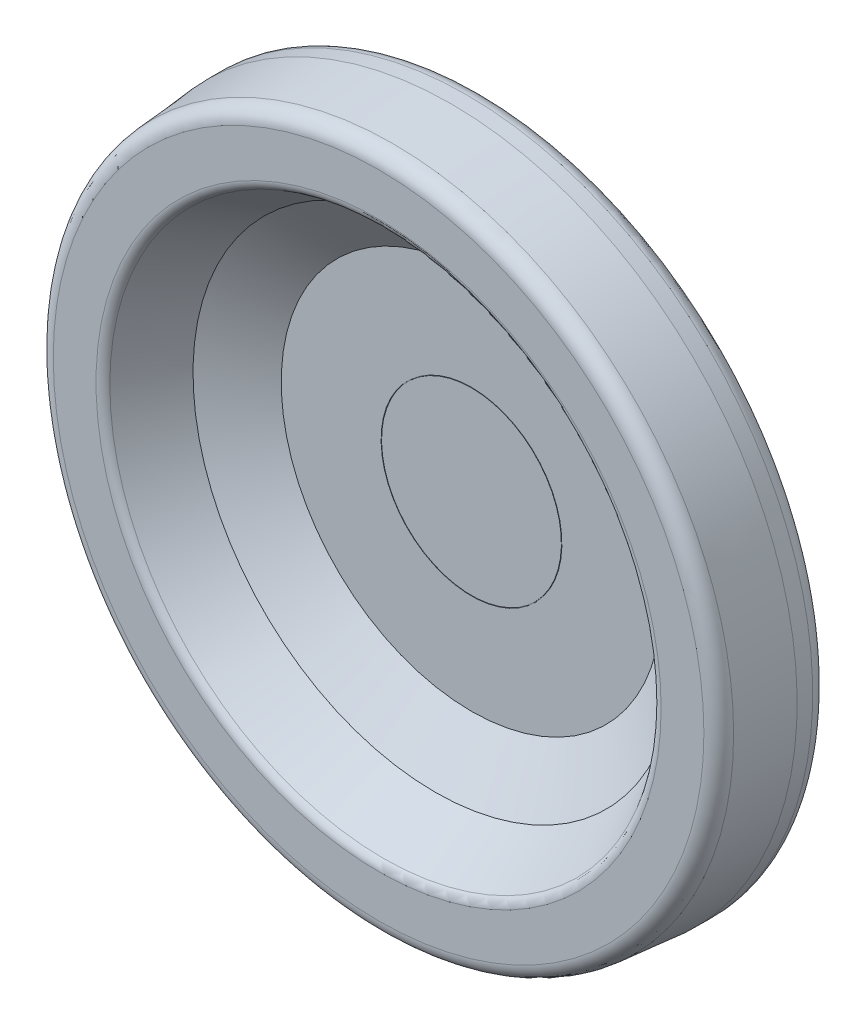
ISO-10303-21;
HEADER;
FILE_DESCRIPTION(('STEP AP214'),'2;1');
FILE_NAME('part.step','',(''),(''),'','','');
FILE_SCHEMA(('AUTOMOTIVE_DESIGN { 1 0 10303 214 1 1 1 1 }'));
ENDSEC;
DATA;
#1=APPLICATION_CONTEXT('core data for automotive mechanical design processes');
#2=APPLICATION_PROTOCOL_DEFINITION('international standard','automotive_design',2000,#1);
#3=PRODUCT_CONTEXT('',#1,'mechanical');
#4=PRODUCT('Part','Part','',(#3));
#5=PRODUCT_RELATED_PRODUCT_CATEGORY('part','',(#4));
#6=PRODUCT_DEFINITION_FORMATION('','',#4);
#7=PRODUCT_DEFINITION_CONTEXT('part definition',#1,'design');
#8=PRODUCT_DEFINITION('design','',#6,#7);
#9=PRODUCT_DEFINITION_SHAPE('','',#8);
#10=(LENGTH_UNIT() NAMED_UNIT(*) SI_UNIT(.MILLI.,.METRE.));
#11=(NAMED_UNIT(*) PLANE_ANGLE_UNIT() SI_UNIT($,.RADIAN.));
#12=(NAMED_UNIT(*) SI_UNIT($,.STERADIAN.) SOLID_ANGLE_UNIT());
#13=UNCERTAINTY_MEASURE_WITH_UNIT(LENGTH_MEASURE(1.E-05),#10,'distance_accuracy_value','');
#14=(GEOMETRIC_REPRESENTATION_CONTEXT(3) GLOBAL_UNCERTAINTY_ASSIGNED_CONTEXT((#13)) GLOBAL_UNIT_ASSIGNED_CONTEXT((#10,
#11,#12)) REPRESENTATION_CONTEXT('',''));
#15=CARTESIAN_POINT('',(0.,0.,0.));
#16=DIRECTION('',(0.,0.,1.));
#17=DIRECTION('',(1.,0.,0.));
#18=AXIS2_PLACEMENT_3D('',#15,#16,#17);
#19=CARTESIAN_POINT('',(13.25,0.,40.));
#20=DIRECTION('',(0.,0.,-1.));
#21=DIRECTION('',(0.,1.,0.));
#22=AXIS2_PLACEMENT_3D('',#19,#20,#21);
#23=PLANE('',#22);
#24=CARTESIAN_POINT('',(0.,0.,40.));
#25=DIRECTION('',(0.,0.,-1.));
#26=DIRECTION('',(0.,1.,0.));
#27=AXIS2_PLACEMENT_3D('',#24,#25,#26);
#28=CIRCLE('',#27,26.5);
#29=CARTESIAN_POINT('',(0.,26.5,40.));
#30=VERTEX_POINT('',#29);
#31=EDGE_CURVE('E391',#30,#30,#28,.T.);
#32=ORIENTED_EDGE('',*,*,#31,.T.);
#33=EDGE_LOOP('',(#32));
#34=FACE_BOUND('',#33,.T.);
#35=ADVANCED_FACE('F14',(#34),#23,.T.);
#36=CARTESIAN_POINT('',(13.,0.,41.15));
#37=DIRECTION('',(0.,0.,1.));
#38=DIRECTION('',(0.,-1.,0.));
#39=AXIS2_PLACEMENT_3D('',#36,#37,#38);
#40=PLANE('',#39);
#41=CARTESIAN_POINT('',(0.,0.,41.15));
#42=DIRECTION('',(0.,0.,-1.));
#43=DIRECTION('',(0.,1.,0.));
#44=AXIS2_PLACEMENT_3D('',#41,#42,#43);
#45=CIRCLE('',#44,26.);
#46=CARTESIAN_POINT('',(0.,26.,41.15));
#47=VERTEX_POINT('',#46);
#48=EDGE_CURVE('E388',#47,#47,#45,.T.);
#49=ORIENTED_EDGE('',*,*,#48,.F.);
#50=EDGE_LOOP('',(#49));
#51=FACE_BOUND('',#50,.T.);
#52=ADVANCED_FACE('F173',(#51),#40,.T.);
#53=CARTESIAN_POINT('',(0.,0.,36.85));
#54=DIRECTION('',(0.,0.,-1.));
#55=DIRECTION('',(0.,1.,0.));
#56=AXIS2_PLACEMENT_3D('',#53,#54,#55);
#57=CYLINDRICAL_SURFACE('',#56,26.5);
#58=CARTESIAN_POINT('',(0.,0.,33.7));
#59=DIRECTION('',(0.,0.,-1.));
#60=DIRECTION('',(0.,1.,0.));
#61=AXIS2_PLACEMENT_3D('',#58,#59,#60);
#62=CIRCLE('',#61,26.5);
#63=CARTESIAN_POINT('',(0.,26.5,33.7));
#64=VERTEX_POINT('',#63);
#65=EDGE_CURVE('E385',#64,#64,#62,.F.);
#66=ORIENTED_EDGE('',*,*,#65,.F.);
#67=EDGE_LOOP('',(#66));
#68=FACE_BOUND('',#67,.T.);
#69=ORIENTED_EDGE('',*,*,#31,.F.);
#70=EDGE_LOOP('',(#69));
#71=FACE_BOUND('',#70,.T.);
#72=ADVANCED_FACE('F169',(#68,#71),#57,.F.);
#73=CARTESIAN_POINT('',(0.,0.,41.023));
#74=DIRECTION('',(0.,0.,-1.));
#75=DIRECTION('',(0.,1.,0.));
#76=AXIS2_PLACEMENT_3D('',#73,#74,#75);
#77=CYLINDRICAL_SURFACE('',#76,26.);
#78=ORIENTED_EDGE('',*,*,#48,.T.);
#79=EDGE_LOOP('',(#78));
#80=FACE_BOUND('',#79,.T.);
#81=CARTESIAN_POINT('',(0.,0.,40.896));
#82=DIRECTION('',(0.,0.,-1.));
#83=DIRECTION('',(0.,1.,0.));
#84=AXIS2_PLACEMENT_3D('',#81,#82,#83);
#85=CIRCLE('',#84,26.);
#86=CARTESIAN_POINT('',(0.,26.,40.896));
#87=VERTEX_POINT('',#86);
#88=EDGE_CURVE('E382',#87,#87,#85,.T.);
#89=ORIENTED_EDGE('',*,*,#88,.F.);
#90=EDGE_LOOP('',(#89));
#91=FACE_BOUND('',#90,.T.);
#92=ADVANCED_FACE('F165',(#80,#91),#77,.T.);
#93=CARTESIAN_POINT('',(25.75,0.,33.7));
#94=DIRECTION('',(0.,0.,1.));
#95=DIRECTION('',(0.,-1.,0.));
#96=AXIS2_PLACEMENT_3D('',#93,#94,#95);
#97=PLANE('',#96);
#98=ORIENTED_EDGE('',*,*,#65,.T.);
#99=EDGE_LOOP('',(#98));
#100=FACE_BOUND('',#99,.T.);
#101=CARTESIAN_POINT('',(0.,0.,33.7));
#102=DIRECTION('',(0.,0.,-1.));
#103=DIRECTION('',(0.,1.,0.));
#104=AXIS2_PLACEMENT_3D('',#101,#102,#103);
#105=CIRCLE('',#104,25.);
#106=CARTESIAN_POINT('',(0.,25.,33.7));
#107=VERTEX_POINT('',#106);
#108=EDGE_CURVE('E379',#107,#107,#105,.T.);
#109=ORIENTED_EDGE('',*,*,#108,.T.);
#110=EDGE_LOOP('',(#109));
#111=FACE_BOUND('',#110,.T.);
#112=ADVANCED_FACE('F161',(#100,#111),#97,.T.);
#113=CARTESIAN_POINT('',(26.0635,0.,40.896));
#114=DIRECTION('',(0.,0.,1.));
#115=DIRECTION('',(0.,-1.,0.));
#116=AXIS2_PLACEMENT_3D('',#113,#114,#115);
#117=PLANE('',#116);
#118=CARTESIAN_POINT('',(0.,0.,40.896));
#119=DIRECTION('',(0.,0.,-1.));
#120=DIRECTION('',(0.,1.,0.));
#121=AXIS2_PLACEMENT_3D('',#118,#119,#120);
#122=CIRCLE('',#121,26.127);
#123=CARTESIAN_POINT('',(0.,26.127,40.896));
#124=VERTEX_POINT('',#123);
#125=EDGE_CURVE('E376',#124,#124,#122,.F.);
#126=ORIENTED_EDGE('',*,*,#125,.T.);
#127=EDGE_LOOP('',(#126));
#128=FACE_BOUND('',#127,.T.);
#129=ORIENTED_EDGE('',*,*,#88,.T.);
#130=EDGE_LOOP('',(#129));
#131=FACE_BOUND('',#130,.T.);
#132=ADVANCED_FACE('F157',(#128,#131),#117,.T.);
#133=CARTESIAN_POINT('',(0.,0.,32.35));
#134=DIRECTION('',(0.,0.,-1.));
#135=DIRECTION('',(0.,1.,0.));
#136=AXIS2_PLACEMENT_3D('',#133,#134,#135);
#137=CYLINDRICAL_SURFACE('',#136,25.);
#138=CARTESIAN_POINT('',(0.,0.,31.));
#139=DIRECTION('',(0.,0.,-1.));
#140=DIRECTION('',(0.,1.,0.));
#141=AXIS2_PLACEMENT_3D('',#138,#139,#140);
#142=CIRCLE('',#141,25.);
#143=CARTESIAN_POINT('',(0.,25.,31.));
#144=VERTEX_POINT('',#143);
#145=EDGE_CURVE('E373',#144,#144,#142,.F.);
#146=ORIENTED_EDGE('',*,*,#145,.F.);
#147=EDGE_LOOP('',(#146));
#148=FACE_BOUND('',#147,.T.);
#149=ORIENTED_EDGE('',*,*,#108,.F.);
#150=EDGE_LOOP('',(#149));
#151=FACE_BOUND('',#150,.T.);
#152=ADVANCED_FACE('F153',(#148,#151),#137,.F.);
#153=CARTESIAN_POINT('',(0.,0.,41.023));
#154=DIRECTION('',(0.,0.,-1.));
#155=DIRECTION('',(0.,1.,0.));
#156=AXIS2_PLACEMENT_3D('',#153,#154,#155);
#157=CYLINDRICAL_SURFACE('',#156,26.127);
#158=ORIENTED_EDGE('',*,*,#125,.F.);
#159=EDGE_LOOP('',(#158));
#160=FACE_BOUND('',#159,.T.);
#161=CARTESIAN_POINT('',(0.,0.,41.15));
#162=DIRECTION('',(0.,0.,-1.));
#163=DIRECTION('',(0.,1.,0.));
#164=AXIS2_PLACEMENT_3D('',#161,#162,#163);
#165=CIRCLE('',#164,26.127);
#166=CARTESIAN_POINT('',(0.,26.127,41.15));
#167=VERTEX_POINT('',#166);
#168=EDGE_CURVE('E370',#167,#167,#165,.T.);
#169=ORIENTED_EDGE('',*,*,#168,.F.);
#170=EDGE_LOOP('',(#169));
#171=FACE_BOUND('',#170,.T.);
#172=ADVANCED_FACE('F149',(#160,#171),#157,.F.);
#173=CARTESIAN_POINT('',(17.5,0.,31.));
#174=DIRECTION('',(0.,0.,1.));
#175=DIRECTION('',(0.,-1.,0.));
#176=AXIS2_PLACEMENT_3D('',#173,#174,#175);
#177=PLANE('',#176);
#178=ORIENTED_EDGE('',*,*,#145,.T.);
#179=EDGE_LOOP('',(#178));
#180=FACE_BOUND('',#179,.T.);
#181=CARTESIAN_POINT('',(0.,0.,31.));
#182=DIRECTION('',(0.,0.,-1.));
#183=DIRECTION('',(0.,1.,0.));
#184=AXIS2_PLACEMENT_3D('',#181,#182,#183);
#185=CIRCLE('',#184,10.);
#186=CARTESIAN_POINT('',(0.,10.,31.));
#187=VERTEX_POINT('',#186);
#188=EDGE_CURVE('E367',#187,#187,#185,.T.);
#189=ORIENTED_EDGE('',*,*,#188,.T.);
#190=EDGE_LOOP('',(#189));
#191=FACE_BOUND('',#190,.T.);
#192=ADVANCED_FACE('F145',(#180,#191),#177,.T.);
#193=CARTESIAN_POINT('',(40.5635,0.,41.15));
#194=DIRECTION('',(0.,0.,1.));
#195=DIRECTION('',(0.,-1.,0.));
#196=AXIS2_PLACEMENT_3D('',#193,#194,#195);
#197=PLANE('',#196);
#198=CARTESIAN_POINT('',(0.,0.,41.15));
#199=DIRECTION('',(0.,0.,1.));
#200=DIRECTION('',(0.,-1.,0.));
#201=AXIS2_PLACEMENT_3D('',#198,#199,#200);
#202=CIRCLE('',#201,55.);
#203=CARTESIAN_POINT('',(0.,-55.,41.15));
#204=VERTEX_POINT('',#203);
#205=EDGE_CURVE('E364',#204,#204,#202,.T.);
#206=ORIENTED_EDGE('',*,*,#205,.T.);
#207=EDGE_LOOP('',(#206));
#208=FACE_BOUND('',#207,.T.);
#209=ORIENTED_EDGE('',*,*,#168,.T.);
#210=EDGE_LOOP('',(#209));
#211=FACE_BOUND('',#210,.T.);
#212=ADVANCED_FACE('F141',(#208,#211),#197,.T.);
#213=CARTESIAN_POINT('',(0.,0.,15.5));
#214=DIRECTION('',(0.,0.,-1.));
#215=DIRECTION('',(0.,1.,0.));
#216=AXIS2_PLACEMENT_3D('',#213,#214,#215);
#217=CYLINDRICAL_SURFACE('',#216,10.);
#218=CARTESIAN_POINT('',(0.,0.,0.));
#219=DIRECTION('',(0.,0.,-1.));
#220=DIRECTION('',(0.,1.,0.));
#221=AXIS2_PLACEMENT_3D('',#218,#219,#220);
#222=CIRCLE('',#221,10.);
#223=CARTESIAN_POINT('',(0.,10.,0.));
#224=VERTEX_POINT('',#223);
#225=EDGE_CURVE('E361',#224,#224,#222,.F.);
#226=ORIENTED_EDGE('',*,*,#225,.F.);
#227=EDGE_LOOP('',(#226));
#228=FACE_BOUND('',#227,.T.);
#229=ORIENTED_EDGE('',*,*,#188,.F.);
#230=EDGE_LOOP('',(#229));
#231=FACE_BOUND('',#230,.T.);
#232=ADVANCED_FACE('F137',(#228,#231),#217,.F.);
#233=CARTESIAN_POINT('',(0.,0.,51.6531130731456));
#234=DIRECTION('',(0.,0.,1.));
#235=DIRECTION('',(0.,-1.,0.));
#236=AXIS2_PLACEMENT_3D('',#233,#234,#235);
#237=CONICAL_SURFACE('',#236,70.,0.959931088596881);
#238=ORIENTED_EDGE('',*,*,#205,.F.);
#239=EDGE_LOOP('',(#238));
#240=FACE_BOUND('',#239,.T.);
#241=CARTESIAN_POINT('',(0.,0.,51.6531130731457));
#242=DIRECTION('',(0.,0.,1.));
#243=DIRECTION('',(1.,0.,0.));
#244=AXIS2_PLACEMENT_3D('',#241,#242,#243);
#245=CIRCLE('',#244,70.);
#246=CARTESIAN_POINT('',(70.,0.,51.6531130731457));
#247=VERTEX_POINT('',#246);
#248=EDGE_CURVE('E355',#247,#247,#245,.T.);
#249=ORIENTED_EDGE('',*,*,#248,.T.);
#250=EDGE_LOOP('',(#249));
#251=FACE_BOUND('',#250,.T.);
#252=ADVANCED_FACE('F133',(#240,#251),#237,.F.);
#253=CARTESIAN_POINT('',(15.,0.,0.));
#254=DIRECTION('',(0.,0.,-1.));
#255=DIRECTION('',(0.,1.,0.));
#256=AXIS2_PLACEMENT_3D('',#253,#254,#255);
#257=PLANE('',#256);
#258=ORIENTED_EDGE('',*,*,#225,.T.);
#259=EDGE_LOOP('',(#258));
#260=FACE_BOUND('',#259,.T.);
#261=CARTESIAN_POINT('',(0.,0.,0.));
#262=DIRECTION('',(0.,0.,-1.));
#263=DIRECTION('',(0.,1.,0.));
#264=AXIS2_PLACEMENT_3D('',#261,#262,#263);
#265=CIRCLE('',#264,20.);
#266=CARTESIAN_POINT('',(0.,20.,0.));
#267=VERTEX_POINT('',#266);
#268=EDGE_CURVE('E358',#267,#267,#265,.F.);
#269=ORIENTED_EDGE('',*,*,#268,.F.);
#270=EDGE_LOOP('',(#269));
#271=FACE_BOUND('',#270,.T.);
#272=ADVANCED_FACE('F129',(#260,#271),#257,.T.);
#273=CARTESIAN_POINT('',(0.,0.,68.));
#274=DIRECTION('',(0.,0.,1.));
#275=DIRECTION('',(0.,-1.,0.));
#276=AXIS2_PLACEMENT_3D('',#273,#274,#275);
#277=CONICAL_SURFACE('',#276,80.,0.549005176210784);
#278=CARTESIAN_POINT('',(0.,0.,66.5655165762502));
#279=DIRECTION('',(0.,0.,1.));
#280=DIRECTION('',(0.,-1.,0.));
#281=AXIS2_PLACEMENT_3D('',#278,#279,#280);
#282=CIRCLE('',#281,79.1224730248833);
#283=CARTESIAN_POINT('',(0.,-79.1224730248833,66.5655165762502));
#284=VERTEX_POINT('',#283);
#285=EDGE_CURVE('E9',#284,#284,#282,.T.);
#286=ORIENTED_EDGE('',*,*,#285,.T.);
#287=EDGE_LOOP('',(#286));
#288=FACE_BOUND('',#287,.T.);
#289=ORIENTED_EDGE('',*,*,#248,.F.);
#290=EDGE_LOOP('',(#289));
#291=FACE_BOUND('',#290,.T.);
#292=ADVANCED_FACE('F125',(#288,#291),#277,.F.);
#293=CARTESIAN_POINT('',(0.,0.,0.127000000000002));
#294=DIRECTION('',(0.,0.,-1.));
#295=DIRECTION('',(0.,1.,0.));
#296=AXIS2_PLACEMENT_3D('',#293,#294,#295);
#297=CYLINDRICAL_SURFACE('',#296,20.);
#298=CARTESIAN_POINT('',(0.,0.,0.254));
#299=DIRECTION('',(0.,0.,-1.));
#300=DIRECTION('',(0.,1.,0.));
#301=AXIS2_PLACEMENT_3D('',#298,#299,#300);
#302=CIRCLE('',#301,20.);
#303=CARTESIAN_POINT('',(0.,20.,0.254));
#304=VERTEX_POINT('',#303);
#305=EDGE_CURVE('E63',#304,#304,#302,.F.);
#306=ORIENTED_EDGE('',*,*,#305,.F.);
#307=EDGE_LOOP('',(#306));
#308=FACE_BOUND('',#307,.T.);
#309=ORIENTED_EDGE('',*,*,#268,.T.);
#310=EDGE_LOOP('',(#309));
#311=FACE_BOUND('',#310,.T.);
#312=ADVANCED_FACE('F112',(#308,#311),#297,.T.);
#313=CARTESIAN_POINT('',(87.0196238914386,0.,68.));
#314=DIRECTION('',(0.,0.,1.));
#315=DIRECTION('',(0.,-1.,0.));
#316=AXIS2_PLACEMENT_3D('',#313,#314,#315);
#317=PLANE('',#316);
#318=CARTESIAN_POINT('',(0.,0.,68.));
#319=DIRECTION('',(0.,0.,1.));
#320=DIRECTION('',(1.,0.,0.));
#321=AXIS2_PLACEMENT_3D('',#318,#319,#320);
#322=CIRCLE('',#321,81.681605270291);
#323=CARTESIAN_POINT('',(81.681605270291,0.,68.));
#324=VERTEX_POINT('',#323);
#325=EDGE_CURVE('E23',#324,#324,#322,.F.);
#326=ORIENTED_EDGE('',*,*,#325,.T.);
#327=EDGE_LOOP('',(#326));
#328=FACE_BOUND('',#327,.T.);
#329=CARTESIAN_POINT('',(0.,0.,68.));
#330=DIRECTION('',(0.,0.,-1.));
#331=DIRECTION('',(0.,-1.,0.));
#332=AXIS2_PLACEMENT_3D('',#329,#330,#331);
#333=CIRCLE('',#332,94.0392477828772);
#334=CARTESIAN_POINT('',(0.,-94.0392477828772,68.));
#335=VERTEX_POINT('',#334);
#336=CARTESIAN_POINT('',(0.,94.0392477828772,68.));
#337=VERTEX_POINT('',#336);
#338=EDGE_CURVE('E53',#335,#337,#333,.T.);
#339=ORIENTED_EDGE('',*,*,#338,.F.);
#340=CARTESIAN_POINT('',(0.,0.,68.));
#341=DIRECTION('',(0.,0.,-1.));
#342=DIRECTION('',(1.,0.,0.));
#343=AXIS2_PLACEMENT_3D('',#340,#341,#342);
#344=CIRCLE('',#343,94.0392477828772);
#345=CARTESIAN_POINT('',(94.0392477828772,0.,68.));
#346=VERTEX_POINT('',#345);
#347=EDGE_CURVE('E59',#346,#335,#344,.T.);
#348=ORIENTED_EDGE('',*,*,#347,.F.);
#349=CARTESIAN_POINT('',(0.,0.,68.));
#350=DIRECTION('',(0.,0.,-1.));
#351=DIRECTION('',(0.,1.,0.));
#352=AXIS2_PLACEMENT_3D('',#349,#350,#351);
#353=CIRCLE('',#352,94.0392477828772);
#354=EDGE_CURVE('E61',#337,#346,#353,.T.);
#355=ORIENTED_EDGE('',*,*,#354,.F.);
#356=EDGE_LOOP('',(#339,#348,#355));
#357=FACE_BOUND('',#356,.T.);
#358=ADVANCED_FACE('F58',(#328,#357),#317,.T.);
#359=CARTESIAN_POINT('',(22.75,0.,0.254));
#360=DIRECTION('',(0.,0.,-1.));
#361=DIRECTION('',(1.,0.,0.));
#362=AXIS2_PLACEMENT_3D('',#359,#360,#361);
#363=PLANE('',#362);
#364=ORIENTED_EDGE('',*,*,#305,.T.);
#365=EDGE_LOOP('',(#364));
#366=FACE_BOUND('',#365,.T.);
#367=CARTESIAN_POINT('',(0.,0.,0.254));
#368=DIRECTION('',(0.,0.,-1.));
#369=DIRECTION('',(0.,1.,0.));
#370=AXIS2_PLACEMENT_3D('',#367,#368,#369);
#371=CIRCLE('',#370,25.5);
#372=CARTESIAN_POINT('',(0.,25.5,0.254));
#373=VERTEX_POINT('',#372);
#374=EDGE_CURVE('E69',#373,#373,#371,.F.);
#375=ORIENTED_EDGE('',*,*,#374,.F.);
#376=EDGE_LOOP('',(#375));
#377=FACE_BOUND('',#376,.T.);
#378=ADVANCED_FACE('F90',(#366,#377),#363,.T.);
#379=CARTESIAN_POINT('',(0.,0.,63.5));
#380=DIRECTION('',(0.,0.,1.));
#381=DIRECTION('',(0.,-1.,0.));
#382=AXIS2_PLACEMENT_3D('',#379,#380,#381);
#383=TOROIDAL_SURFACE('',#382,94.0392477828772,4.5);
#384=CARTESIAN_POINT('',(0.,0.,63.8922008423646));
#385=DIRECTION('',(0.,0.,-1.));
#386=DIRECTION('',(1.,0.,0.));
#387=AXIS2_PLACEMENT_3D('',#384,#385,#386);
#388=CIRCLE('',#387,98.52212392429);
#389=CARTESIAN_POINT('',(98.52212392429,0.,63.8922008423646));
#390=VERTEX_POINT('',#389);
#391=EDGE_CURVE('E100',#390,#390,#388,.T.);
#392=ORIENTED_EDGE('',*,*,#391,.F.);
#393=EDGE_LOOP('',(#392));
#394=FACE_BOUND('',#393,.T.);
#395=ORIENTED_EDGE('',*,*,#354,.T.);
#396=ORIENTED_EDGE('',*,*,#347,.T.);
#397=ORIENTED_EDGE('',*,*,#338,.T.);
#398=EDGE_LOOP('',(#395,#396,#397));
#399=FACE_BOUND('',#398,.T.);
#400=ADVANCED_FACE('F67',(#394,#399),#383,.T.);
#401=CARTESIAN_POINT('',(0.,0.,11.565217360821));
#402=DIRECTION('',(0.,0.,-1.));
#403=DIRECTION('',(0.,1.,0.));
#404=AXIS2_PLACEMENT_3D('',#401,#402,#403);
#405=CYLINDRICAL_SURFACE('',#404,25.5);
#406=CARTESIAN_POINT('',(0.,0.,22.8764347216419));
#407=DIRECTION('',(0.,0.,1.));
#408=DIRECTION('',(0.,-1.,0.));
#409=AXIS2_PLACEMENT_3D('',#406,#407,#408);
#410=CIRCLE('',#409,25.5);
#411=CARTESIAN_POINT('',(0.,-25.5,22.8764347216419));
#412=VERTEX_POINT('',#411);
#413=EDGE_CURVE('E98',#412,#412,#410,.F.);
#414=ORIENTED_EDGE('',*,*,#413,.T.);
#415=EDGE_LOOP('',(#414));
#416=FACE_BOUND('',#415,.T.);
#417=ORIENTED_EDGE('',*,*,#374,.T.);
#418=EDGE_LOOP('',(#417));
#419=FACE_BOUND('',#418,.T.);
#420=ADVANCED_FACE('F89',(#416,#419),#405,.T.);
#421=CARTESIAN_POINT('',(0.,0.,47.));
#422=DIRECTION('',(0.,0.,-1.));
#423=DIRECTION('',(0.,1.,0.));
#424=AXIS2_PLACEMENT_3D('',#421,#422,#423);
#425=CONICAL_SURFACE('',#424,100.,0.0872664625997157);
#426=CARTESIAN_POINT('',(0.,0.,47.));
#427=DIRECTION('',(0.,0.,-1.));
#428=DIRECTION('',(0.,1.,0.));
#429=AXIS2_PLACEMENT_3D('',#426,#427,#428);
#430=CIRCLE('',#429,100.);
#431=CARTESIAN_POINT('',(0.,100.,47.));
#432=VERTEX_POINT('',#431);
#433=EDGE_CURVE('E341',#432,#432,#430,.T.);
#434=ORIENTED_EDGE('',*,*,#433,.F.);
#435=EDGE_LOOP('',(#434));
#436=FACE_BOUND('',#435,.T.);
#437=ORIENTED_EDGE('',*,*,#391,.T.);
#438=EDGE_LOOP('',(#437));
#439=FACE_BOUND('',#438,.T.);
#440=ADVANCED_FACE('F329',(#436,#439),#425,.T.);
#441=CARTESIAN_POINT('',(0.,0.,22.8764347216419));
#442=DIRECTION('',(0.,0.,1.));
#443=DIRECTION('',(0.,-1.,0.));
#444=AXIS2_PLACEMENT_3D('',#441,#442,#443);
#445=TOROIDAL_SURFACE('',#444,30.,4.5);
#446=CARTESIAN_POINT('',(0.,0.,27.2297238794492));
#447=DIRECTION('',(0.,0.,1.));
#448=DIRECTION('',(1.,0.,0.));
#449=AXIS2_PLACEMENT_3D('',#446,#447,#448);
#450=CIRCLE('',#449,28.8603186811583);
#451=CARTESIAN_POINT('',(28.8603186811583,0.,27.2297238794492));
#452=VERTEX_POINT('',#451);
#453=EDGE_CURVE('E320',#452,#452,#450,.T.);
#454=ORIENTED_EDGE('',*,*,#453,.F.);
#455=EDGE_LOOP('',(#454));
#456=FACE_BOUND('',#455,.T.);
#457=ORIENTED_EDGE('',*,*,#413,.F.);
#458=EDGE_LOOP('',(#457));
#459=FACE_BOUND('',#458,.T.);
#460=ADVANCED_FACE('F326',(#456,#459),#445,.F.);
#461=CARTESIAN_POINT('',(0.,0.,44.75));
#462=DIRECTION('',(0.,0.,-1.));
#463=DIRECTION('',(0.,1.,0.));
#464=AXIS2_PLACEMENT_3D('',#461,#462,#463);
#465=CYLINDRICAL_SURFACE('',#464,100.);
#466=CARTESIAN_POINT('',(0.,0.,42.5));
#467=DIRECTION('',(0.,0.,1.));
#468=DIRECTION('',(0.,-1.,0.));
#469=AXIS2_PLACEMENT_3D('',#466,#467,#468);
#470=CIRCLE('',#469,100.);
#471=CARTESIAN_POINT('',(0.,-100.,42.5));
#472=VERTEX_POINT('',#471);
#473=EDGE_CURVE('E316',#472,#472,#470,.F.);
#474=ORIENTED_EDGE('',*,*,#473,.F.);
#475=EDGE_LOOP('',(#474));
#476=FACE_BOUND('',#475,.T.);
#477=ORIENTED_EDGE('',*,*,#433,.T.);
#478=EDGE_LOOP('',(#477));
#479=FACE_BOUND('',#478,.T.);
#480=ADVANCED_FACE('F328',(#476,#479),#465,.T.);
#481=CARTESIAN_POINT('',(0.,0.,37.8532891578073));
#482=DIRECTION('',(0.,0.,1.));
#483=DIRECTION('',(0.,-1.,0.));
#484=AXIS2_PLACEMENT_3D('',#481,#482,#483);
#485=CONICAL_SURFACE('',#484,69.4396023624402,1.31474508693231);
#486=CARTESIAN_POINT('',(0.,0.,37.8532891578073));
#487=DIRECTION('',(0.,0.,1.));
#488=DIRECTION('',(0.,-1.,0.));
#489=AXIS2_PLACEMENT_3D('',#486,#487,#488);
#490=CIRCLE('',#489,69.4396023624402);
#491=CARTESIAN_POINT('',(0.,-69.4396023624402,37.8532891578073));
#492=VERTEX_POINT('',#491);
#493=EDGE_CURVE('E314',#492,#492,#490,.F.);
#494=ORIENTED_EDGE('',*,*,#493,.T.);
#495=EDGE_LOOP('',(#494));
#496=FACE_BOUND('',#495,.T.);
#497=ORIENTED_EDGE('',*,*,#453,.T.);
#498=EDGE_LOOP('',(#497));
#499=FACE_BOUND('',#498,.T.);
#500=ADVANCED_FACE('F268',(#496,#499),#485,.T.);
#501=CARTESIAN_POINT('',(0.,0.,42.5));
#502=DIRECTION('',(0.,0.,1.));
#503=DIRECTION('',(0.,-1.,0.));
#504=AXIS2_PLACEMENT_3D('',#501,#502,#503);
#505=TOROIDAL_SURFACE('',#504,95.5,4.5);
#506=ORIENTED_EDGE('',*,*,#473,.T.);
#507=EDGE_LOOP('',(#506));
#508=FACE_BOUND('',#507,.T.);
#509=CARTESIAN_POINT('',(0.,0.,38.));
#510=DIRECTION('',(0.,0.,1.));
#511=DIRECTION('',(0.,1.,0.));
#512=AXIS2_PLACEMENT_3D('',#509,#510,#511);
#513=CIRCLE('',#512,95.5);
#514=CARTESIAN_POINT('',(0.,-95.5,38.));
#515=VERTEX_POINT('',#514);
#516=CARTESIAN_POINT('',(0.,95.5,38.));
#517=VERTEX_POINT('',#516);
#518=EDGE_CURVE('E311',#515,#517,#513,.F.);
#519=ORIENTED_EDGE('',*,*,#518,.F.);
#520=CARTESIAN_POINT('',(0.,0.,38.));
#521=DIRECTION('',(0.,0.,1.));
#522=DIRECTION('',(0.,-1.,0.));
#523=AXIS2_PLACEMENT_3D('',#520,#521,#522);
#524=CIRCLE('',#523,95.5);
#525=CARTESIAN_POINT('',(95.5,0.,38.));
#526=VERTEX_POINT('',#525);
#527=EDGE_CURVE('E312',#526,#515,#524,.F.);
#528=ORIENTED_EDGE('',*,*,#527,.F.);
#529=CARTESIAN_POINT('',(0.,0.,38.));
#530=DIRECTION('',(0.,0.,1.));
#531=DIRECTION('',(1.,0.,0.));
#532=AXIS2_PLACEMENT_3D('',#529,#530,#531);
#533=CIRCLE('',#532,95.5);
#534=EDGE_CURVE('E291',#517,#526,#533,.F.);
#535=ORIENTED_EDGE('',*,*,#534,.F.);
#536=EDGE_LOOP('',(#519,#528,#535));
#537=FACE_BOUND('',#536,.T.);
#538=ADVANCED_FACE('F195',(#508,#537),#505,.T.);
#539=CARTESIAN_POINT('',(0.,0.,33.4999999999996));
#540=DIRECTION('',(0.,0.,1.));
#541=DIRECTION('',(0.,-1.,0.));
#542=AXIS2_PLACEMENT_3D('',#539,#540,#541);
#543=TOROIDAL_SURFACE('',#542,70.5792836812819,4.50000000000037);
#544=CARTESIAN_POINT('',(0.,0.,38.));
#545=DIRECTION('',(0.,0.,-1.));
#546=DIRECTION('',(1.,0.,0.));
#547=AXIS2_PLACEMENT_3D('',#544,#545,#546);
#548=CIRCLE('',#547,70.5792836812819);
#549=CARTESIAN_POINT('',(0.,-70.5792836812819,38.));
#550=VERTEX_POINT('',#549);
#551=CARTESIAN_POINT('',(70.5792836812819,0.,38.));
#552=VERTEX_POINT('',#551);
#553=EDGE_CURVE('E31',#550,#552,#548,.F.);
#554=ORIENTED_EDGE('',*,*,#553,.F.);
#555=CARTESIAN_POINT('',(0.,0.,38.));
#556=DIRECTION('',(0.,0.,-1.));
#557=DIRECTION('',(0.,-1.,0.));
#558=AXIS2_PLACEMENT_3D('',#555,#556,#557);
#559=CIRCLE('',#558,70.5792836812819);
#560=CARTESIAN_POINT('',(0.,70.5792836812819,38.));
#561=VERTEX_POINT('',#560);
#562=EDGE_CURVE('E310',#561,#550,#559,.F.);
#563=ORIENTED_EDGE('',*,*,#562,.F.);
#564=CARTESIAN_POINT('',(0.,0.,38.));
#565=DIRECTION('',(0.,0.,-1.));
#566=DIRECTION('',(0.,1.,0.));
#567=AXIS2_PLACEMENT_3D('',#564,#565,#566);
#568=CIRCLE('',#567,70.5792836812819);
#569=EDGE_CURVE('E253',#552,#561,#568,.F.);
#570=ORIENTED_EDGE('',*,*,#569,.F.);
#571=EDGE_LOOP('',(#554,#563,#570));
#572=FACE_BOUND('',#571,.T.);
#573=ORIENTED_EDGE('',*,*,#493,.F.);
#574=EDGE_LOOP('',(#573));
#575=FACE_BOUND('',#574,.T.);
#576=ADVANCED_FACE('F188',(#572,#575),#543,.F.);
#577=CARTESIAN_POINT('',(83.0396418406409,0.,38.));
#578=DIRECTION('',(0.,0.,-1.));
#579=DIRECTION('',(0.,1.,0.));
#580=AXIS2_PLACEMENT_3D('',#577,#578,#579);
#581=PLANE('',#580);
#582=ORIENTED_EDGE('',*,*,#562,.T.);
#583=ORIENTED_EDGE('',*,*,#553,.T.);
#584=ORIENTED_EDGE('',*,*,#569,.T.);
#585=EDGE_LOOP('',(#582,#583,#584));
#586=FACE_BOUND('',#585,.T.);
#587=ORIENTED_EDGE('',*,*,#527,.T.);
#588=ORIENTED_EDGE('',*,*,#518,.T.);
#589=ORIENTED_EDGE('',*,*,#534,.T.);
#590=EDGE_LOOP('',(#587,#588,#589));
#591=FACE_BOUND('',#590,.T.);
#592=ADVANCED_FACE('F185',(#586,#591),#581,.T.);
#593=CARTESIAN_POINT('',(0.,0.,65.));
#594=DIRECTION('',(0.,0.,1.));
#595=DIRECTION('',(1.,0.,0.));
#596=AXIS2_PLACEMENT_3D('',#593,#594,#595);
#597=TOROIDAL_SURFACE('',#596,81.681605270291,3.);
#598=ORIENTED_EDGE('',*,*,#285,.F.);
#599=EDGE_LOOP('',(#598));
#600=FACE_BOUND('',#599,.T.);
#601=ORIENTED_EDGE('',*,*,#325,.F.);
#602=EDGE_LOOP('',(#601));
#603=FACE_BOUND('',#602,.T.);
#604=ADVANCED_FACE('F16',(#600,#603),#597,.T.);
#605=CLOSED_SHELL('',(#35,#52,#72,#92,#112,#132,#152,#172,#192,#212,#232,#252,#272,#292,#312,
#358,#378,#400,#420,#440,#460,#480,#500,#538,#576,#592,#604));
#606=MANIFOLD_SOLID_BREP('B1',#605);
#607=ADVANCED_BREP_SHAPE_REPRESENTATION('',(#18,#606),#14);
#608=SHAPE_DEFINITION_REPRESENTATION(#9,#607);
ENDSEC;
END-ISO-10303-21;
